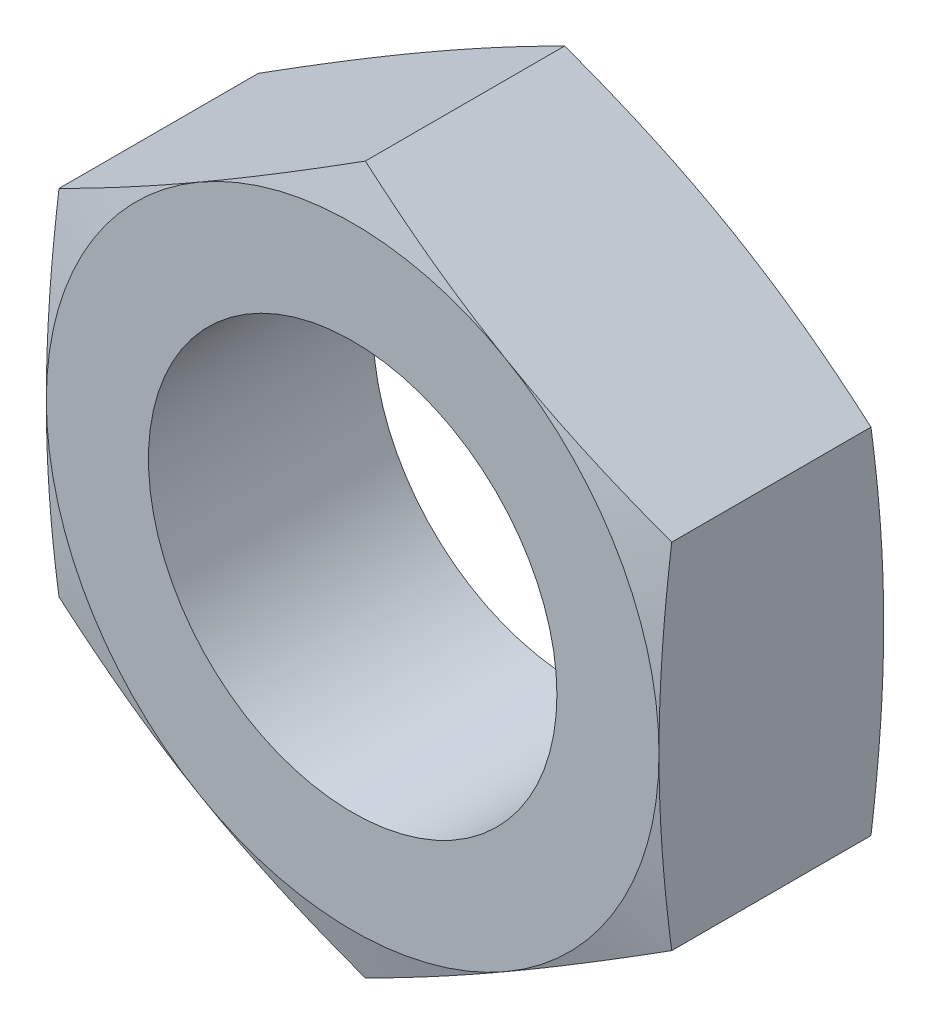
ISO-10303-21;
HEADER;
FILE_DESCRIPTION(('STEP AP214'),'2;1');
FILE_NAME('part.step','',(''),(''),'','','');
FILE_SCHEMA(('AUTOMOTIVE_DESIGN { 1 0 10303 214 1 1 1 1 }'));
ENDSEC;
DATA;
#1=APPLICATION_CONTEXT('core data for automotive mechanical design processes');
#2=APPLICATION_PROTOCOL_DEFINITION('international standard','automotive_design',2000,#1);
#3=PRODUCT_CONTEXT('',#1,'mechanical');
#4=PRODUCT('Part','Part','',(#3));
#5=PRODUCT_RELATED_PRODUCT_CATEGORY('part','',(#4));
#6=PRODUCT_DEFINITION_FORMATION('','',#4);
#7=PRODUCT_DEFINITION_CONTEXT('part definition',#1,'design');
#8=PRODUCT_DEFINITION('design','',#6,#7);
#9=PRODUCT_DEFINITION_SHAPE('','',#8);
#10=(LENGTH_UNIT() NAMED_UNIT(*) SI_UNIT(.MILLI.,.METRE.));
#11=(NAMED_UNIT(*) PLANE_ANGLE_UNIT() SI_UNIT($,.RADIAN.));
#12=(NAMED_UNIT(*) SI_UNIT($,.STERADIAN.) SOLID_ANGLE_UNIT());
#13=UNCERTAINTY_MEASURE_WITH_UNIT(LENGTH_MEASURE(1.E-05),#10,'distance_accuracy_value','');
#14=(GEOMETRIC_REPRESENTATION_CONTEXT(3) GLOBAL_UNCERTAINTY_ASSIGNED_CONTEXT((#13)) GLOBAL_UNIT_ASSIGNED_CONTEXT((#10,
#11,#12)) REPRESENTATION_CONTEXT('',''));
#15=CARTESIAN_POINT('',(0.,0.,0.));
#16=DIRECTION('',(0.,0.,1.));
#17=DIRECTION('',(1.,0.,0.));
#18=AXIS2_PLACEMENT_3D('',#15,#16,#17);
#19=CARTESIAN_POINT('',(0.,0.,11.));
#20=DIRECTION('',(0.,0.,1.));
#21=DIRECTION('',(1.,0.,0.));
#22=AXIS2_PLACEMENT_3D('',#19,#20,#21);
#23=PLANE('',#22);
#24=CARTESIAN_POINT('',(0.,0.,11.));
#25=DIRECTION('',(0.,0.,1.));
#26=DIRECTION('',(1.,0.,0.));
#27=AXIS2_PLACEMENT_3D('',#24,#25,#26);
#28=CIRCLE('',#27,10.);
#29=CARTESIAN_POINT('',(10.,0.,11.));
#30=VERTEX_POINT('',#29);
#31=EDGE_CURVE('E238',#30,#30,#28,.T.);
#32=ORIENTED_EDGE('',*,*,#31,.F.);
#33=EDGE_LOOP('',(#32));
#34=FACE_BOUND('',#33,.T.);
#35=CARTESIAN_POINT('',(0.,0.,11.));
#36=DIRECTION('',(0.,0.,1.));
#37=DIRECTION('',(1.,0.,0.));
#38=AXIS2_PLACEMENT_3D('',#35,#36,#37);
#39=CIRCLE('',#38,15.);
#40=CARTESIAN_POINT('',(7.5,-12.9903810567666,11.));
#41=VERTEX_POINT('',#40);
#42=CARTESIAN_POINT('',(15.,0.,11.));
#43=VERTEX_POINT('',#42);
#44=EDGE_CURVE('E150',#41,#43,#39,.T.);
#45=ORIENTED_EDGE('',*,*,#44,.T.);
#46=CARTESIAN_POINT('',(7.5,12.9903810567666,11.));
#47=VERTEX_POINT('',#46);
#48=EDGE_CURVE('E152',#43,#47,#39,.T.);
#49=ORIENTED_EDGE('',*,*,#48,.T.);
#50=CARTESIAN_POINT('',(-7.5,12.9903810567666,11.));
#51=VERTEX_POINT('',#50);
#52=EDGE_CURVE('E372',#47,#51,#39,.T.);
#53=ORIENTED_EDGE('',*,*,#52,.T.);
#54=CARTESIAN_POINT('',(-15.,0.,11.));
#55=VERTEX_POINT('',#54);
#56=EDGE_CURVE('E36',#51,#55,#39,.T.);
#57=ORIENTED_EDGE('',*,*,#56,.T.);
#58=CARTESIAN_POINT('',(-7.5,-12.9903810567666,11.));
#59=VERTEX_POINT('',#58);
#60=EDGE_CURVE('E44',#55,#59,#39,.T.);
#61=ORIENTED_EDGE('',*,*,#60,.T.);
#62=EDGE_CURVE('E374',#59,#41,#39,.T.);
#63=ORIENTED_EDGE('',*,*,#62,.T.);
#64=EDGE_LOOP('',(#45,#49,#53,#57,#61,#63));
#65=FACE_BOUND('',#64,.T.);
#66=ADVANCED_FACE('F14',(#34,#65),#23,.T.);
#67=CARTESIAN_POINT('',(0.,0.,0.));
#68=DIRECTION('',(0.,0.,1.));
#69=DIRECTION('',(1.,0.,0.));
#70=AXIS2_PLACEMENT_3D('',#67,#68,#69);
#71=PLANE('',#70);
#72=CARTESIAN_POINT('',(0.,0.,0.));
#73=DIRECTION('',(0.,0.,1.));
#74=DIRECTION('',(1.,0.,0.));
#75=AXIS2_PLACEMENT_3D('',#72,#73,#74);
#76=CIRCLE('',#75,10.);
#77=CARTESIAN_POINT('',(10.,0.,0.));
#78=VERTEX_POINT('',#77);
#79=EDGE_CURVE('E242',#78,#78,#76,.T.);
#80=ORIENTED_EDGE('',*,*,#79,.T.);
#81=EDGE_LOOP('',(#80));
#82=FACE_BOUND('',#81,.T.);
#83=CARTESIAN_POINT('',(0.,0.,0.));
#84=DIRECTION('',(0.,0.,1.));
#85=DIRECTION('',(1.,0.,0.));
#86=AXIS2_PLACEMENT_3D('',#83,#84,#85);
#87=CIRCLE('',#86,15.);
#88=CARTESIAN_POINT('',(15.,0.,0.));
#89=VERTEX_POINT('',#88);
#90=CARTESIAN_POINT('',(7.5,12.9903810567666,0.));
#91=VERTEX_POINT('',#90);
#92=EDGE_CURVE('E122',#89,#91,#87,.T.);
#93=ORIENTED_EDGE('',*,*,#92,.F.);
#94=CARTESIAN_POINT('',(7.5,-12.9903810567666,0.));
#95=VERTEX_POINT('',#94);
#96=EDGE_CURVE('E151',#95,#89,#87,.T.);
#97=ORIENTED_EDGE('',*,*,#96,.F.);
#98=CARTESIAN_POINT('',(-7.5,-12.9903810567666,0.));
#99=VERTEX_POINT('',#98);
#100=EDGE_CURVE('E147',#99,#95,#87,.T.);
#101=ORIENTED_EDGE('',*,*,#100,.F.);
#102=CARTESIAN_POINT('',(-15.,0.,0.));
#103=VERTEX_POINT('',#102);
#104=EDGE_CURVE('E146',#103,#99,#87,.T.);
#105=ORIENTED_EDGE('',*,*,#104,.F.);
#106=CARTESIAN_POINT('',(-7.5,12.9903810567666,0.));
#107=VERTEX_POINT('',#106);
#108=EDGE_CURVE('E123',#107,#103,#87,.T.);
#109=ORIENTED_EDGE('',*,*,#108,.F.);
#110=EDGE_CURVE('E111',#91,#107,#87,.T.);
#111=ORIENTED_EDGE('',*,*,#110,.F.);
#112=EDGE_LOOP('',(#93,#97,#101,#105,#109,#111));
#113=FACE_BOUND('',#112,.T.);
#114=ADVANCED_FACE('F144',(#82,#113),#71,.F.);
#115=CARTESIAN_POINT('',(0.,0.,11.));
#116=DIRECTION('',(0.,0.,-1.));
#117=DIRECTION('',(-1.,0.,0.));
#118=AXIS2_PLACEMENT_3D('',#115,#116,#117);
#119=CYLINDRICAL_SURFACE('',#118,10.);
#120=ORIENTED_EDGE('',*,*,#31,.T.);
#121=EDGE_LOOP('',(#120));
#122=FACE_BOUND('',#121,.T.);
#123=ORIENTED_EDGE('',*,*,#79,.F.);
#124=EDGE_LOOP('',(#123));
#125=FACE_BOUND('',#124,.T.);
#126=ADVANCED_FACE('F182',(#122,#125),#119,.F.);
#127=CARTESIAN_POINT('',(0.,0.,1.64069528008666));
#128=DIRECTION('',(0.,0.,1.));
#129=DIRECTION('',(1.,0.,0.));
#130=AXIS2_PLACEMENT_3D('',#127,#128,#129);
#131=CONICAL_SURFACE('',#130,21.123158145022,1.30899693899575);
#132=CARTESIAN_POINT('',(15.0002,-8.66013856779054,0.621809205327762));
#133=CARTESIAN_POINT('',(14.3772710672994,-9.01978675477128,0.525403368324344));
#134=CARTESIAN_POINT('',(13.7532127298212,-9.38008700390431,0.437882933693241));
#135=CARTESIAN_POINT('',(12.5028922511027,-10.1019598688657,0.284117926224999));
#136=CARTESIAN_POINT('',(11.8766293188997,-10.4635329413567,0.21788199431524));
#137=CARTESIAN_POINT('',(10.6256964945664,-11.1857593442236,0.110552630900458));
#138=CARTESIAN_POINT('',(10.0010350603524,-11.5464077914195,0.069331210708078));
#139=CARTESIAN_POINT('',(8.7509156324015,-12.2681645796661,0.0140575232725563));
#140=CARTESIAN_POINT('',(8.12545781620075,-12.6292728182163,0.));
#141=CARTESIAN_POINT('',(6.87454218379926,-13.3514892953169,0.));
#142=CARTESIAN_POINT('',(6.24908436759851,-13.7125975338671,0.0140575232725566));
#143=CARTESIAN_POINT('',(4.99896493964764,-14.4343543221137,0.0693312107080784));
#144=CARTESIAN_POINT('',(4.37430350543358,-14.7950027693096,0.110552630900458));
#145=CARTESIAN_POINT('',(3.12337068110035,-15.5172291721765,0.217881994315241));
#146=CARTESIAN_POINT('',(2.49710774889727,-15.8788022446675,0.284117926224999));
#147=CARTESIAN_POINT('',(1.24678727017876,-16.6006751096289,0.437882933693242));
#148=CARTESIAN_POINT('',(0.622728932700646,-16.9609753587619,0.525403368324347));
#149=CARTESIAN_POINT('',(-0.000200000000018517,-17.3206235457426,0.621809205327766));
#150=B_SPLINE_CURVE_WITH_KNOTS('',3,(#132,#133,#134,#135,#136,#137,#138,#139,#140,#141,#142,
#143,#144,#145,#146,#147,#148,#149),.UNSPECIFIED.,.F.,.F.,(4,2,2,2,2,2,2,2,4),(0.,
2.17729853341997,4.35547987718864,6.52242029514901,8.68894138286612,10.8554624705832,
13.0224028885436,15.2005842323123,17.3778827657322),.UNSPECIFIED.);
#151=CARTESIAN_POINT('',(15.,-8.66025403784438,0.621778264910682));
#152=VERTEX_POINT('',#151);
#153=EDGE_CURVE('E153',#152,#95,#150,.T.);
#154=ORIENTED_EDGE('',*,*,#153,.T.);
#155=ORIENTED_EDGE('',*,*,#96,.T.);
#156=CARTESIAN_POINT('',(15.,-22.9699203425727,3.33164551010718));
#157=CARTESIAN_POINT('',(15.,-22.288720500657,3.17885963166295));
#158=CARTESIAN_POINT('',(15.,-21.6070962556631,3.02793226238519));
#159=CARTESIAN_POINT('',(15.,-20.2427903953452,2.73079782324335));
#160=CARTESIAN_POINT('',(15.,-19.5601087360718,2.58459095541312));
#161=CARTESIAN_POINT('',(15.,-18.192876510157,2.2977753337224));
#162=CARTESIAN_POINT('',(15.,-17.5083247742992,2.15717213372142));
#163=CARTESIAN_POINT('',(15.,-16.1378008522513,1.88307184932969));
#164=CARTESIAN_POINT('',(15.,-15.4518286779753,1.74957470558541));
#165=CARTESIAN_POINT('',(15.,-14.0836898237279,1.49240952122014));
#166=CARTESIAN_POINT('',(15.,-13.4015363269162,1.36867168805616));
#167=CARTESIAN_POINT('',(15.,-12.0353545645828,1.13192961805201));
#168=CARTESIAN_POINT('',(15.,-11.35132629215,1.01892542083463));
#169=CARTESIAN_POINT('',(15.,-9.98128099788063,0.806187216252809));
#170=CARTESIAN_POINT('',(15.,-9.29526424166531,0.706451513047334));
#171=CARTESIAN_POINT('',(15.,-7.92104574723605,0.523176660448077));
#172=CARTESIAN_POINT('',(15.,-7.23284400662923,0.439637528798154));
#173=CARTESIAN_POINT('',(15.,-5.84646558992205,0.291108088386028));
#174=CARTESIAN_POINT('',(15.,-5.14826471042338,0.226340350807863));
#175=CARTESIAN_POINT('',(15.,-3.75009465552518,0.119813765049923));
#176=CARTESIAN_POINT('',(15.,-3.05012552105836,0.0780543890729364));
#177=CARTESIAN_POINT('',(15.,-1.64943623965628,0.0199793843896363));
#178=CARTESIAN_POINT('',(15.,-0.948716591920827,0.00365195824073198));
#179=CARTESIAN_POINT('',(15.,0.45284136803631,-0.00255392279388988));
#180=CARTESIAN_POINT('',(15.,1.15367968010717,0.00756758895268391));
#181=CARTESIAN_POINT('',(15.,2.55704799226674,0.0536910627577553));
#182=CARTESIAN_POINT('',(15.,3.25957482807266,0.0897873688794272));
#183=CARTESIAN_POINT('',(15.,4.66298433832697,0.185794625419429));
#184=CARTESIAN_POINT('',(15.,5.36386697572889,0.245706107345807));
#185=CARTESIAN_POINT('',(15.,6.76398096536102,0.386302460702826));
#186=CARTESIAN_POINT('',(15.,7.4632109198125,0.467001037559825));
#187=CARTESIAN_POINT('',(15.,8.85941811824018,0.645795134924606));
#188=CARTESIAN_POINT('',(15.,9.55639535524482,0.743890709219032));
#189=CARTESIAN_POINT('',(15.,10.9074957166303,0.948173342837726));
#190=CARTESIAN_POINT('',(15.,11.5617422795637,1.05355220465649));
#191=CARTESIAN_POINT('',(15.,12.868494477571,1.27465052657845));
#192=CARTESIAN_POINT('',(15.,13.5210000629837,1.39037027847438));
#193=CARTESIAN_POINT('',(15.,14.8245209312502,1.63024703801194));
#194=CARTESIAN_POINT('',(15.,15.4755360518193,1.75440492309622));
#195=CARTESIAN_POINT('',(15.,16.7762074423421,2.00958916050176));
#196=CARTESIAN_POINT('',(15.,17.4258637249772,2.1406154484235));
#197=CARTESIAN_POINT('',(15.,18.7241773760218,2.40832075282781));
#198=CARTESIAN_POINT('',(15.,19.3728344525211,2.5450011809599));
#199=CARTESIAN_POINT('',(15.,20.669156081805,2.82298543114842));
#200=CARTESIAN_POINT('',(15.,21.3168206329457,2.96428926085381));
#201=CARTESIAN_POINT('',(15.,22.6112593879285,3.25071214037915));
#202=CARTESIAN_POINT('',(15.,23.2580336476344,3.39583093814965));
#203=CARTESIAN_POINT('',(15.,24.5508585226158,3.68925978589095));
#204=CARTESIAN_POINT('',(15.,25.1969091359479,3.83756984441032));
#205=CARTESIAN_POINT('',(15.,27.1213525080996,4.28352964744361));
#206=CARTESIAN_POINT('',(15.,28.3988444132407,4.58506650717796));
#207=CARTESIAN_POINT('',(15.,30.9520523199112,5.19564098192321));
#208=CARTESIAN_POINT('',(15.,32.2277682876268,5.50467873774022));
#209=CARTESIAN_POINT('',(15.,34.7762293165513,6.12792205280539));
#210=CARTESIAN_POINT('',(15.,36.0489760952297,6.44212059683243));
#211=CARTESIAN_POINT('',(15.,37.9572890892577,6.9165690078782));
#212=CARTESIAN_POINT('',(15.,38.5932484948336,7.07524095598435));
#213=CARTESIAN_POINT('',(15.,39.8649337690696,7.39351520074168));
#214=CARTESIAN_POINT('',(15.,40.5006596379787,7.55311749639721));
#215=CARTESIAN_POINT('',(15.,41.1362837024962,7.71312438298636));
#216=B_SPLINE_CURVE_WITH_KNOTS('',3,(#156,#157,#158,#159,#160,#161,#162,#163,#164,#165,#166,
#167,#168,#169,#170,#171,#172,#173,#174,#175,#176,#177,#178,#179,#180,#181,#182,#183,#184,#185,
#186,#187,#188,#189,#190,#191,#192,#193,#194,#195,#196,#197,#198,#199,#200,#201,#202,#203,#204,
#205,#206,#207,#208,#209,#210,#211,#212,#213,#214,#215),.UNSPECIFIED.,.F.,.F.,(4,2,2,2,2,2,2,2,
2,2,2,2,2,2,2,2,2,2,2,2,2,2,2,2,2,2,2,2,2,4),(0.,2.09437965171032,4.18884882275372,
6.28534468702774,8.3818230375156,10.4616102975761,12.5414052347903,14.6209340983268,
16.7004652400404,18.8037292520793,20.9069450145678,23.0091848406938,25.1114220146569,
27.2213335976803,29.331292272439,31.4426456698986,33.5540055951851,35.5419439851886,
37.5299384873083,39.5181400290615,41.5063229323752,43.4950052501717,45.4836908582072,
47.4722454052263,49.4608052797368,53.398558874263,57.3363864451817,61.2692436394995,
63.235607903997,65.2019700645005),.UNSPECIFIED.);
#217=EDGE_CURVE('E186',#89,#152,#216,.F.);
#218=ORIENTED_EDGE('',*,*,#217,.T.);
#219=EDGE_LOOP('',(#154,#155,#218));
#220=FACE_BOUND('',#219,.T.);
#221=ADVANCED_FACE('F179',(#220),#131,.T.);
#222=CARTESIAN_POINT('',(-0.00019999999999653,17.3206235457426,0.621809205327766));
#223=CARTESIAN_POINT('',(0.622728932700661,16.9609753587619,0.525403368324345));
#224=CARTESIAN_POINT('',(1.24678727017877,16.6006751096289,0.43788293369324));
#225=CARTESIAN_POINT('',(2.49710774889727,15.8788022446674,0.284117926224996));
#226=CARTESIAN_POINT('',(3.12337068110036,15.5172291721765,0.217881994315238));
#227=CARTESIAN_POINT('',(4.37430350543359,14.7950027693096,0.110552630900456));
#228=CARTESIAN_POINT('',(4.99896493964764,14.4343543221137,0.0693312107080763));
#229=CARTESIAN_POINT('',(6.24908436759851,13.7125975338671,0.014057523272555));
#230=CARTESIAN_POINT('',(6.87454218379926,13.3514892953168,0.));
#231=CARTESIAN_POINT('',(8.12545781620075,12.6292728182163,0.));
#232=CARTESIAN_POINT('',(8.7509156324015,12.2681645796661,0.0140575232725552));
#233=CARTESIAN_POINT('',(10.0010350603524,11.5464077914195,0.0693312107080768));
#234=CARTESIAN_POINT('',(10.6256964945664,11.1857593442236,0.110552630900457));
#235=CARTESIAN_POINT('',(11.8766293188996,10.4635329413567,0.217881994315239));
#236=CARTESIAN_POINT('',(12.5028922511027,10.1019598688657,0.284117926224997));
#237=CARTESIAN_POINT('',(13.7532127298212,9.38008700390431,0.43788293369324));
#238=CARTESIAN_POINT('',(14.3772710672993,9.01978675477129,0.525403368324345));
#239=CARTESIAN_POINT('',(15.0002,8.66013856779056,0.621809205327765));
#240=B_SPLINE_CURVE_WITH_KNOTS('',3,(#222,#223,#224,#225,#226,#227,#228,#229,#230,#231,#232,
#233,#234,#235,#236,#237,#238,#239),.UNSPECIFIED.,.F.,.F.,(4,2,2,2,2,2,2,2,4),(0.,
2.17729853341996,4.35547987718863,6.52242029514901,8.68894138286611,10.8554624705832,
13.0224028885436,15.2005842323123,17.3778827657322),.UNSPECIFIED.);
#241=CARTESIAN_POINT('',(15.,8.6602540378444,0.621778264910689));
#242=VERTEX_POINT('',#241);
#243=EDGE_CURVE('E162',#91,#242,#240,.T.);
#244=ORIENTED_EDGE('',*,*,#243,.T.);
#245=EDGE_CURVE('E257',#242,#89,#216,.F.);
#246=ORIENTED_EDGE('',*,*,#245,.T.);
#247=ORIENTED_EDGE('',*,*,#92,.T.);
#248=EDGE_LOOP('',(#244,#246,#247));
#249=FACE_BOUND('',#248,.T.);
#250=ADVANCED_FACE('F277',(#249),#131,.T.);
#251=CARTESIAN_POINT('',(0.,0.,11.));
#252=DIRECTION('',(0.,0.,-1.));
#253=DIRECTION('',(-1.,0.,0.));
#254=AXIS2_PLACEMENT_3D('',#251,#252,#253);
#255=CONICAL_SURFACE('',#254,15.,1.30899693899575);
#256=CARTESIAN_POINT('',(15.0002,8.66013856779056,10.3781907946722));
#257=CARTESIAN_POINT('',(14.3772710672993,9.01978675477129,10.4745966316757));
#258=CARTESIAN_POINT('',(13.7532127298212,9.38008700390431,10.5621170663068));
#259=CARTESIAN_POINT('',(12.5028922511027,10.1019598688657,10.715882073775));
#260=CARTESIAN_POINT('',(11.8766293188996,10.4635329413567,10.7821180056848));
#261=CARTESIAN_POINT('',(10.6256964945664,11.1857593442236,10.8894473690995));
#262=CARTESIAN_POINT('',(10.0010350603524,11.5464077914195,10.9306687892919));
#263=CARTESIAN_POINT('',(8.7509156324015,12.2681645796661,10.9859424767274));
#264=CARTESIAN_POINT('',(8.12545781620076,12.6292728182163,11.));
#265=CARTESIAN_POINT('',(6.87454218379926,13.3514892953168,11.));
#266=CARTESIAN_POINT('',(6.24908436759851,13.7125975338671,10.9859424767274));
#267=CARTESIAN_POINT('',(4.99896493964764,14.4343543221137,10.9306687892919));
#268=CARTESIAN_POINT('',(4.37430350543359,14.7950027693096,10.8894473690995));
#269=CARTESIAN_POINT('',(3.12337068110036,15.5172291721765,10.7821180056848));
#270=CARTESIAN_POINT('',(2.49710774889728,15.8788022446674,10.715882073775));
#271=CARTESIAN_POINT('',(1.24678727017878,16.6006751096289,10.5621170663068));
#272=CARTESIAN_POINT('',(0.622728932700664,16.9609753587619,10.4745966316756));
#273=CARTESIAN_POINT('',(-0.000199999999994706,17.3206235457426,10.3781907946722));
#274=B_SPLINE_CURVE_WITH_KNOTS('',3,(#256,#257,#258,#259,#260,#261,#262,#263,#264,#265,#266,
#267,#268,#269,#270,#271,#272,#273),.UNSPECIFIED.,.F.,.F.,(4,2,2,2,2,2,2,2,4),(0.,
2.17729853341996,4.35547987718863,6.522420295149,8.68894138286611,10.8554624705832,
13.0224028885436,15.2005842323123,17.3778827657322),.UNSPECIFIED.);
#275=CARTESIAN_POINT('',(15.,8.6602540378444,10.3782217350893));
#276=VERTEX_POINT('',#275);
#277=EDGE_CURVE('E237',#276,#47,#274,.T.);
#278=ORIENTED_EDGE('',*,*,#277,.T.);
#279=ORIENTED_EDGE('',*,*,#48,.F.);
#280=CARTESIAN_POINT('',(15.,-22.9699203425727,7.66835448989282));
#281=CARTESIAN_POINT('',(15.,-22.288720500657,7.82114036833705));
#282=CARTESIAN_POINT('',(15.,-21.6070962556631,7.97206773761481));
#283=CARTESIAN_POINT('',(15.,-20.2427903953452,8.26920217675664));
#284=CARTESIAN_POINT('',(15.,-19.5601087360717,8.41540904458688));
#285=CARTESIAN_POINT('',(15.,-18.192876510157,8.7022246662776));
#286=CARTESIAN_POINT('',(15.,-17.5083247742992,8.84282786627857));
#287=CARTESIAN_POINT('',(15.,-16.1378008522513,9.11692815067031));
#288=CARTESIAN_POINT('',(15.,-15.4518286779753,9.25042529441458));
#289=CARTESIAN_POINT('',(15.,-14.0836898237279,9.50759047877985));
#290=CARTESIAN_POINT('',(15.,-13.4015363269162,9.63132831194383));
#291=CARTESIAN_POINT('',(15.,-12.0353545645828,9.86807038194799));
#292=CARTESIAN_POINT('',(15.,-11.35132629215,9.98107457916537));
#293=CARTESIAN_POINT('',(15.,-9.98128099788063,10.1938127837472));
#294=CARTESIAN_POINT('',(15.,-9.29526424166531,10.2935484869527));
#295=CARTESIAN_POINT('',(15.,-7.92104574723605,10.4768233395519));
#296=CARTESIAN_POINT('',(15.,-7.23284400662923,10.5603624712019));
#297=CARTESIAN_POINT('',(15.,-5.84646558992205,10.708891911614));
#298=CARTESIAN_POINT('',(15.,-5.14826471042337,10.7736596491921));
#299=CARTESIAN_POINT('',(15.,-3.75009465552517,10.8801862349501));
#300=CARTESIAN_POINT('',(15.,-3.05012552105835,10.9219456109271));
#301=CARTESIAN_POINT('',(15.,-1.64943623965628,10.9800206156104));
#302=CARTESIAN_POINT('',(15.,-0.948716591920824,10.9963480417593));
#303=CARTESIAN_POINT('',(15.,0.452841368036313,11.0025539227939));
#304=CARTESIAN_POINT('',(15.,1.15367968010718,10.9924324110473));
#305=CARTESIAN_POINT('',(15.,2.55704799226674,10.9463089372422));
#306=CARTESIAN_POINT('',(15.,3.25957482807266,10.9102126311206));
#307=CARTESIAN_POINT('',(15.,4.66298433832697,10.8142053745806));
#308=CARTESIAN_POINT('',(15.,5.36386697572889,10.7542938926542));
#309=CARTESIAN_POINT('',(15.,6.76398096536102,10.6136975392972));
#310=CARTESIAN_POINT('',(15.,7.4632109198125,10.5329989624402));
#311=CARTESIAN_POINT('',(15.,8.85941811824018,10.3542048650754));
#312=CARTESIAN_POINT('',(15.,9.55639535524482,10.256109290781));
#313=CARTESIAN_POINT('',(15.,10.9074957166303,10.0518266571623));
#314=CARTESIAN_POINT('',(15.,11.5617422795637,9.94644779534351));
#315=CARTESIAN_POINT('',(15.,12.868494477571,9.72534947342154));
#316=CARTESIAN_POINT('',(15.,13.5210000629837,9.60962972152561));
#317=CARTESIAN_POINT('',(15.,14.8245209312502,9.36975296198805));
#318=CARTESIAN_POINT('',(15.,15.4755360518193,9.24559507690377));
#319=CARTESIAN_POINT('',(15.,16.7762074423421,8.99041083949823));
#320=CARTESIAN_POINT('',(15.,17.4258637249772,8.85938455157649));
#321=CARTESIAN_POINT('',(15.,18.7241773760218,8.59167924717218));
#322=CARTESIAN_POINT('',(15.,19.3728344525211,8.45499881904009));
#323=CARTESIAN_POINT('',(15.,20.669156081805,8.17701456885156));
#324=CARTESIAN_POINT('',(15.,21.3168206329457,8.03571073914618));
#325=CARTESIAN_POINT('',(15.,22.6112593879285,7.74928785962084));
#326=CARTESIAN_POINT('',(15.,23.2580336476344,7.60416906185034));
#327=CARTESIAN_POINT('',(15.,24.5508585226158,7.31074021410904));
#328=CARTESIAN_POINT('',(15.,25.1969091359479,7.16243015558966));
#329=CARTESIAN_POINT('',(15.,27.1213525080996,6.71647035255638));
#330=CARTESIAN_POINT('',(15.,28.3988444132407,6.41493349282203));
#331=CARTESIAN_POINT('',(15.,30.9520523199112,5.80435901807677));
#332=CARTESIAN_POINT('',(15.,32.2277682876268,5.49532126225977));
#333=CARTESIAN_POINT('',(15.,34.7762293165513,4.87207794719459));
#334=CARTESIAN_POINT('',(15.,36.0489760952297,4.55787940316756));
#335=CARTESIAN_POINT('',(15.,37.9572890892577,4.08343099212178));
#336=CARTESIAN_POINT('',(15.,38.5932484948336,3.92475904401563));
#337=CARTESIAN_POINT('',(15.,39.8649337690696,3.6064847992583));
#338=CARTESIAN_POINT('',(15.,40.5006596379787,3.44688250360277));
#339=CARTESIAN_POINT('',(15.,41.1362837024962,3.28687561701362));
#340=B_SPLINE_CURVE_WITH_KNOTS('',3,(#280,#281,#282,#283,#284,#285,#286,#287,#288,#289,#290,
#291,#292,#293,#294,#295,#296,#297,#298,#299,#300,#301,#302,#303,#304,#305,#306,#307,#308,#309,
#310,#311,#312,#313,#314,#315,#316,#317,#318,#319,#320,#321,#322,#323,#324,#325,#326,#327,#328,
#329,#330,#331,#332,#333,#334,#335,#336,#337,#338,#339),.UNSPECIFIED.,.F.,.F.,(4,2,2,2,2,2,2,2,
2,2,2,2,2,2,2,2,2,2,2,2,2,2,2,2,2,2,2,2,2,4),(0.,2.09437965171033,4.18884882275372,
6.28534468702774,8.3818230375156,10.4616102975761,12.5414052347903,14.6209340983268,
16.7004652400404,18.8037292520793,20.9069450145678,23.0091848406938,25.1114220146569,
27.2213335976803,29.331292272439,31.4426456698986,33.5540055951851,35.5419439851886,
37.5299384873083,39.5181400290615,41.5063229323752,43.4950052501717,45.4836908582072,
47.4722454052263,49.4608052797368,53.398558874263,57.3363864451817,61.2692436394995,
63.235607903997,65.2019700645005),.UNSPECIFIED.);
#341=EDGE_CURVE('E19',#43,#276,#340,.T.);
#342=ORIENTED_EDGE('',*,*,#341,.T.);
#343=EDGE_LOOP('',(#278,#279,#342));
#344=FACE_BOUND('',#343,.T.);
#345=ADVANCED_FACE('F180',(#344),#255,.T.);
#346=CARTESIAN_POINT('',(-0.000200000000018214,-17.3206235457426,10.3781907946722));
#347=CARTESIAN_POINT('',(0.622728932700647,-16.9609753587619,10.4745966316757));
#348=CARTESIAN_POINT('',(1.24678727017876,-16.6006751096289,10.5621170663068));
#349=CARTESIAN_POINT('',(2.49710774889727,-15.8788022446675,10.715882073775));
#350=CARTESIAN_POINT('',(3.12337068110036,-15.5172291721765,10.7821180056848));
#351=CARTESIAN_POINT('',(4.37430350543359,-14.7950027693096,10.8894473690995));
#352=CARTESIAN_POINT('',(4.99896493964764,-14.4343543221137,10.9306687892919));
#353=CARTESIAN_POINT('',(6.24908436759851,-13.7125975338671,10.9859424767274));
#354=CARTESIAN_POINT('',(6.87454218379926,-13.3514892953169,11.));
#355=CARTESIAN_POINT('',(8.12545781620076,-12.6292728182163,11.));
#356=CARTESIAN_POINT('',(8.7509156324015,-12.2681645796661,10.9859424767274));
#357=CARTESIAN_POINT('',(10.0010350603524,-11.5464077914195,10.9306687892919));
#358=CARTESIAN_POINT('',(10.6256964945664,-11.1857593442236,10.8894473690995));
#359=CARTESIAN_POINT('',(11.8766293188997,-10.4635329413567,10.7821180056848));
#360=CARTESIAN_POINT('',(12.5028922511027,-10.1019598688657,10.715882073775));
#361=CARTESIAN_POINT('',(13.7532127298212,-9.38008700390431,10.5621170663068));
#362=CARTESIAN_POINT('',(14.3772710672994,-9.01978675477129,10.4745966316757));
#363=CARTESIAN_POINT('',(15.0002,-8.66013856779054,10.3781907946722));
#364=B_SPLINE_CURVE_WITH_KNOTS('',3,(#346,#347,#348,#349,#350,#351,#352,#353,#354,#355,#356,
#357,#358,#359,#360,#361,#362,#363),.UNSPECIFIED.,.F.,.F.,(4,2,2,2,2,2,2,2,4),(0.,
2.17729853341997,4.35547987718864,6.52242029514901,8.68894138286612,10.8554624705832,
13.0224028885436,15.2005842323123,17.3778827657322),.UNSPECIFIED.);
#365=CARTESIAN_POINT('',(15.,-8.66025403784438,10.3782217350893));
#366=VERTEX_POINT('',#365);
#367=EDGE_CURVE('E285',#41,#366,#364,.T.);
#368=ORIENTED_EDGE('',*,*,#367,.T.);
#369=EDGE_CURVE('E9',#366,#43,#340,.T.);
#370=ORIENTED_EDGE('',*,*,#369,.T.);
#371=ORIENTED_EDGE('',*,*,#44,.F.);
#372=EDGE_LOOP('',(#368,#370,#371));
#373=FACE_BOUND('',#372,.T.);
#374=ADVANCED_FACE('F341',(#373),#255,.T.);
#375=CARTESIAN_POINT('',(0.000199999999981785,-17.3206235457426,0.621809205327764));
#376=CARTESIAN_POINT('',(-0.622728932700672,-16.9609753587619,0.525403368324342));
#377=CARTESIAN_POINT('',(-1.24678727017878,-16.6006751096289,0.437882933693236));
#378=CARTESIAN_POINT('',(-2.49710774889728,-15.8788022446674,0.284117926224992));
#379=CARTESIAN_POINT('',(-3.12337068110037,-15.5172291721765,0.217881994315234));
#380=CARTESIAN_POINT('',(-4.3743035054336,-14.7950027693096,0.110552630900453));
#381=CARTESIAN_POINT('',(-4.99896493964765,-14.4343543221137,0.0693312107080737));
#382=CARTESIAN_POINT('',(-6.24908436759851,-13.7125975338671,0.0140575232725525));
#383=CARTESIAN_POINT('',(-6.87454218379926,-13.3514892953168,0.));
#384=CARTESIAN_POINT('',(-8.12545781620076,-12.6292728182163,0.));
#385=CARTESIAN_POINT('',(-8.7509156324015,-12.2681645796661,0.0140575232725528));
#386=CARTESIAN_POINT('',(-10.0010350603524,-11.5464077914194,0.069331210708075));
#387=CARTESIAN_POINT('',(-10.6256964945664,-11.1857593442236,0.110552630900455));
#388=CARTESIAN_POINT('',(-11.8766293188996,-10.4635329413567,0.217881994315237));
#389=CARTESIAN_POINT('',(-12.5028922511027,-10.1019598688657,0.284117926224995));
#390=CARTESIAN_POINT('',(-13.7532127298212,-9.3800870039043,0.437882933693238));
#391=CARTESIAN_POINT('',(-14.3772710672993,-9.01978675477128,0.525403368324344));
#392=CARTESIAN_POINT('',(-15.0002,-8.66013856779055,0.621809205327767));
#393=B_SPLINE_CURVE_WITH_KNOTS('',3,(#375,#376,#377,#378,#379,#380,#381,#382,#383,#384,#385,
#386,#387,#388,#389,#390,#391,#392),.UNSPECIFIED.,.F.,.F.,(4,2,2,2,2,2,2,2,4),(0.,
2.17729853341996,4.35547987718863,6.522420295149,8.6889413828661,10.8554624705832,
13.0224028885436,15.2005842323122,17.3778827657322),.UNSPECIFIED.);
#394=CARTESIAN_POINT('',(0.,-17.3205080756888,0.62177826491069));
#395=VERTEX_POINT('',#394);
#396=EDGE_CURVE('E142',#395,#99,#393,.T.);
#397=ORIENTED_EDGE('',*,*,#396,.T.);
#398=ORIENTED_EDGE('',*,*,#100,.T.);
#399=EDGE_CURVE('E163',#95,#395,#150,.T.);
#400=ORIENTED_EDGE('',*,*,#399,.T.);
#401=EDGE_LOOP('',(#397,#398,#400));
#402=FACE_BOUND('',#401,.T.);
#403=ADVANCED_FACE('F338',(#402),#131,.T.);
#404=CARTESIAN_POINT('',(-15.0002,-8.66013856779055,10.3781907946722));
#405=CARTESIAN_POINT('',(-14.3772710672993,-9.01978675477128,10.4745966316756));
#406=CARTESIAN_POINT('',(-13.7532127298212,-9.3800870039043,10.5621170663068));
#407=CARTESIAN_POINT('',(-12.5028922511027,-10.1019598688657,10.715882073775));
#408=CARTESIAN_POINT('',(-11.8766293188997,-10.4635329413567,10.7821180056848));
#409=CARTESIAN_POINT('',(-10.6256964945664,-11.1857593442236,10.8894473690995));
#410=CARTESIAN_POINT('',(-10.0010350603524,-11.5464077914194,10.9306687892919));
#411=CARTESIAN_POINT('',(-8.7509156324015,-12.2681645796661,10.9859424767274));
#412=CARTESIAN_POINT('',(-8.12545781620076,-12.6292728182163,11.));
#413=CARTESIAN_POINT('',(-6.87454218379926,-13.3514892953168,11.));
#414=CARTESIAN_POINT('',(-6.24908436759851,-13.7125975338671,10.9859424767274));
#415=CARTESIAN_POINT('',(-4.99896493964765,-14.4343543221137,10.9306687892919));
#416=CARTESIAN_POINT('',(-4.37430350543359,-14.7950027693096,10.8894473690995));
#417=CARTESIAN_POINT('',(-3.12337068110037,-15.5172291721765,10.7821180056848));
#418=CARTESIAN_POINT('',(-2.49710774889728,-15.8788022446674,10.715882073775));
#419=CARTESIAN_POINT('',(-1.24678727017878,-16.6006751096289,10.5621170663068));
#420=CARTESIAN_POINT('',(-0.622728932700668,-16.9609753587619,10.4745966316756));
#421=CARTESIAN_POINT('',(0.000199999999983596,-17.3206235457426,10.3781907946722));
#422=B_SPLINE_CURVE_WITH_KNOTS('',3,(#404,#405,#406,#407,#408,#409,#410,#411,#412,#413,#414,
#415,#416,#417,#418,#419,#420,#421),.UNSPECIFIED.,.F.,.F.,(4,2,2,2,2,2,2,2,4),(0.,
2.17729853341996,4.35547987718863,6.52242029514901,8.68894138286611,10.8554624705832,
13.0224028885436,15.2005842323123,17.3778827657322),.UNSPECIFIED.);
#423=CARTESIAN_POINT('',(0.,-17.3205080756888,10.3782217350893));
#424=VERTEX_POINT('',#423);
#425=EDGE_CURVE('E290',#59,#424,#422,.T.);
#426=ORIENTED_EDGE('',*,*,#425,.T.);
#427=EDGE_CURVE('E286',#424,#41,#364,.T.);
#428=ORIENTED_EDGE('',*,*,#427,.T.);
#429=ORIENTED_EDGE('',*,*,#62,.F.);
#430=EDGE_LOOP('',(#426,#428,#429));
#431=FACE_BOUND('',#430,.T.);
#432=ADVANCED_FACE('F177',(#431),#255,.T.);
#433=CARTESIAN_POINT('',(-15.,-22.9699203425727,3.33164551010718));
#434=CARTESIAN_POINT('',(-15.,-22.288720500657,3.17885963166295));
#435=CARTESIAN_POINT('',(-15.,-21.6070962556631,3.02793226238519));
#436=CARTESIAN_POINT('',(-15.,-20.2427903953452,2.73079782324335));
#437=CARTESIAN_POINT('',(-15.,-19.5601087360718,2.58459095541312));
#438=CARTESIAN_POINT('',(-15.,-18.192876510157,2.2977753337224));
#439=CARTESIAN_POINT('',(-15.,-17.5083247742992,2.15717213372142));
#440=CARTESIAN_POINT('',(-15.,-16.1378008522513,1.88307184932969));
#441=CARTESIAN_POINT('',(-15.,-15.4518286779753,1.74957470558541));
#442=CARTESIAN_POINT('',(-15.,-14.0836898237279,1.49240952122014));
#443=CARTESIAN_POINT('',(-15.,-13.4015363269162,1.36867168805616));
#444=CARTESIAN_POINT('',(-15.,-12.0353545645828,1.13192961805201));
#445=CARTESIAN_POINT('',(-15.,-11.35132629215,1.01892542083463));
#446=CARTESIAN_POINT('',(-15.,-9.98128099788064,0.80618721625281));
#447=CARTESIAN_POINT('',(-15.,-9.29526424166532,0.706451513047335));
#448=CARTESIAN_POINT('',(-15.,-7.92104574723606,0.52317666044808));
#449=CARTESIAN_POINT('',(-15.,-7.23284400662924,0.439637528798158));
#450=CARTESIAN_POINT('',(-15.,-5.84646558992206,0.291108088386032));
#451=CARTESIAN_POINT('',(-15.,-5.14826471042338,0.226340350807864));
#452=CARTESIAN_POINT('',(-15.,-3.75009465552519,0.119813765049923));
#453=CARTESIAN_POINT('',(-15.,-3.05012552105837,0.0780543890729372));
#454=CARTESIAN_POINT('',(-15.,-1.64943623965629,0.0199793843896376));
#455=CARTESIAN_POINT('',(-15.,-0.948716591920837,0.00365195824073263));
#456=CARTESIAN_POINT('',(-15.,0.4528413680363,-0.00255392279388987));
#457=CARTESIAN_POINT('',(-15.,1.15367968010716,0.00756758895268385));
#458=CARTESIAN_POINT('',(-15.,2.55704799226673,0.053691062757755));
#459=CARTESIAN_POINT('',(-15.,3.25957482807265,0.0897873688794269));
#460=CARTESIAN_POINT('',(-15.,4.66298433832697,0.185794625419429));
#461=CARTESIAN_POINT('',(-15.,5.36386697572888,0.245706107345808));
#462=CARTESIAN_POINT('',(-15.,6.76398096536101,0.386302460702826));
#463=CARTESIAN_POINT('',(-15.,7.4632109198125,0.467001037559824));
#464=CARTESIAN_POINT('',(-15.,8.85941811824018,0.645795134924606));
#465=CARTESIAN_POINT('',(-15.,9.55639535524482,0.743890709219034));
#466=CARTESIAN_POINT('',(-15.,10.9074957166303,0.948173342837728));
#467=CARTESIAN_POINT('',(-15.,11.5617422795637,1.05355220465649));
#468=CARTESIAN_POINT('',(-15.,12.868494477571,1.27465052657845));
#469=CARTESIAN_POINT('',(-15.,13.5210000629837,1.39037027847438));
#470=CARTESIAN_POINT('',(-15.,14.8245209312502,1.63024703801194));
#471=CARTESIAN_POINT('',(-15.,15.4755360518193,1.75440492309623));
#472=CARTESIAN_POINT('',(-15.,16.7762074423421,2.00958916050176));
#473=CARTESIAN_POINT('',(-15.,17.4258637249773,2.1406154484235));
#474=CARTESIAN_POINT('',(-15.,18.7241773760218,2.40832075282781));
#475=CARTESIAN_POINT('',(-15.,19.3728344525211,2.5450011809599));
#476=CARTESIAN_POINT('',(-15.,20.669156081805,2.82298543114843));
#477=CARTESIAN_POINT('',(-15.,21.3168206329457,2.96428926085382));
#478=CARTESIAN_POINT('',(-15.,22.6112593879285,3.25071214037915));
#479=CARTESIAN_POINT('',(-15.,23.2580336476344,3.39583093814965));
#480=CARTESIAN_POINT('',(-15.,24.5508585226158,3.68925978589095));
#481=CARTESIAN_POINT('',(-15.,25.1969091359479,3.83756984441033));
#482=CARTESIAN_POINT('',(-15.,27.1213525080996,4.28352964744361));
#483=CARTESIAN_POINT('',(-15.,28.3988444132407,4.58506650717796));
#484=CARTESIAN_POINT('',(-15.,30.9520523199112,5.19564098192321));
#485=CARTESIAN_POINT('',(-15.,32.2277682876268,5.50467873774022));
#486=CARTESIAN_POINT('',(-15.,34.7762293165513,6.12792205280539));
#487=CARTESIAN_POINT('',(-15.,36.0489760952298,6.44212059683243));
#488=CARTESIAN_POINT('',(-15.,37.9572890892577,6.9165690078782));
#489=CARTESIAN_POINT('',(-15.,38.5932484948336,7.07524095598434));
#490=CARTESIAN_POINT('',(-15.,39.8649337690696,7.39351520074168));
#491=CARTESIAN_POINT('',(-15.,40.5006596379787,7.55311749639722));
#492=CARTESIAN_POINT('',(-15.,41.1362837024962,7.71312438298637));
#493=B_SPLINE_CURVE_WITH_KNOTS('',3,(#433,#434,#435,#436,#437,#438,#439,#440,#441,#442,#443,
#444,#445,#446,#447,#448,#449,#450,#451,#452,#453,#454,#455,#456,#457,#458,#459,#460,#461,#462,
#463,#464,#465,#466,#467,#468,#469,#470,#471,#472,#473,#474,#475,#476,#477,#478,#479,#480,#481,
#482,#483,#484,#485,#486,#487,#488,#489,#490,#491,#492),.UNSPECIFIED.,.F.,.F.,(4,2,2,2,2,2,2,2,
2,2,2,2,2,2,2,2,2,2,2,2,2,2,2,2,2,2,2,2,2,4),(0.,2.09437965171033,4.18884882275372,
6.28534468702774,8.3818230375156,10.461610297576,12.5414052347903,14.6209340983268,
16.7004652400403,18.8037292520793,20.9069450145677,23.0091848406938,25.1114220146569,
27.2213335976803,29.331292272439,31.4426456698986,33.5540055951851,35.5419439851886,
37.5299384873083,39.5181400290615,41.5063229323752,43.4950052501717,45.4836908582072,
47.4722454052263,49.4608052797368,53.398558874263,57.3363864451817,61.2692436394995,
63.235607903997,65.2019700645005),.UNSPECIFIED.);
#494=CARTESIAN_POINT('',(-15.,-8.66025403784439,0.621778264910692));
#495=VERTEX_POINT('',#494);
#496=EDGE_CURVE('E284',#495,#103,#493,.T.);
#497=ORIENTED_EDGE('',*,*,#496,.T.);
#498=ORIENTED_EDGE('',*,*,#104,.T.);
#499=EDGE_CURVE('E135',#99,#495,#393,.T.);
#500=ORIENTED_EDGE('',*,*,#499,.T.);
#501=EDGE_LOOP('',(#497,#498,#500));
#502=FACE_BOUND('',#501,.T.);
#503=ADVANCED_FACE('F172',(#502),#131,.T.);
#504=CARTESIAN_POINT('',(-15.,-22.9699203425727,7.66835448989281));
#505=CARTESIAN_POINT('',(-15.,-22.288720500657,7.82114036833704));
#506=CARTESIAN_POINT('',(-15.,-21.6070962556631,7.9720677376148));
#507=CARTESIAN_POINT('',(-15.,-20.2427903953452,8.26920217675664));
#508=CARTESIAN_POINT('',(-15.,-19.5601087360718,8.41540904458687));
#509=CARTESIAN_POINT('',(-15.,-18.192876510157,8.7022246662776));
#510=CARTESIAN_POINT('',(-15.,-17.5083247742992,8.84282786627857));
#511=CARTESIAN_POINT('',(-15.,-16.1378008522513,9.1169281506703));
#512=CARTESIAN_POINT('',(-15.,-15.4518286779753,9.25042529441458));
#513=CARTESIAN_POINT('',(-15.,-14.0836898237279,9.50759047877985));
#514=CARTESIAN_POINT('',(-15.,-13.4015363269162,9.63132831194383));
#515=CARTESIAN_POINT('',(-15.,-12.0353545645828,9.86807038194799));
#516=CARTESIAN_POINT('',(-15.,-11.35132629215,9.98107457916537));
#517=CARTESIAN_POINT('',(-15.,-9.98128099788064,10.1938127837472));
#518=CARTESIAN_POINT('',(-15.,-9.29526424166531,10.2935484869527));
#519=CARTESIAN_POINT('',(-15.,-7.92104574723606,10.4768233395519));
#520=CARTESIAN_POINT('',(-15.,-7.23284400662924,10.5603624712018));
#521=CARTESIAN_POINT('',(-15.,-5.84646558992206,10.708891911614));
#522=CARTESIAN_POINT('',(-15.,-5.14826471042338,10.7736596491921));
#523=CARTESIAN_POINT('',(-15.,-3.75009465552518,10.8801862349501));
#524=CARTESIAN_POINT('',(-15.,-3.05012552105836,10.9219456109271));
#525=CARTESIAN_POINT('',(-15.,-1.64943623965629,10.9800206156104));
#526=CARTESIAN_POINT('',(-15.,-0.948716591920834,10.9963480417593));
#527=CARTESIAN_POINT('',(-15.,0.452841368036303,11.0025539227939));
#528=CARTESIAN_POINT('',(-15.,1.15367968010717,10.9924324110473));
#529=CARTESIAN_POINT('',(-15.,2.55704799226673,10.9463089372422));
#530=CARTESIAN_POINT('',(-15.,3.25957482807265,10.9102126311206));
#531=CARTESIAN_POINT('',(-15.,4.66298433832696,10.8142053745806));
#532=CARTESIAN_POINT('',(-15.,5.36386697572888,10.7542938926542));
#533=CARTESIAN_POINT('',(-15.,6.76398096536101,10.6136975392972));
#534=CARTESIAN_POINT('',(-15.,7.4632109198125,10.5329989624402));
#535=CARTESIAN_POINT('',(-15.,8.85941811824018,10.3542048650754));
#536=CARTESIAN_POINT('',(-15.,9.55639535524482,10.256109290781));
#537=CARTESIAN_POINT('',(-15.,10.9074957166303,10.0518266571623));
#538=CARTESIAN_POINT('',(-15.,11.5617422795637,9.94644779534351));
#539=CARTESIAN_POINT('',(-15.,12.868494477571,9.72534947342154));
#540=CARTESIAN_POINT('',(-15.,13.5210000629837,9.60962972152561));
#541=CARTESIAN_POINT('',(-15.,14.8245209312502,9.36975296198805));
#542=CARTESIAN_POINT('',(-15.,15.4755360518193,9.24559507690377));
#543=CARTESIAN_POINT('',(-15.,16.7762074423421,8.99041083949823));
#544=CARTESIAN_POINT('',(-15.,17.4258637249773,8.85938455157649));
#545=CARTESIAN_POINT('',(-15.,18.7241773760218,8.59167924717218));
#546=CARTESIAN_POINT('',(-15.,19.3728344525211,8.45499881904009));
#547=CARTESIAN_POINT('',(-15.,20.669156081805,8.17701456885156));
#548=CARTESIAN_POINT('',(-15.,21.3168206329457,8.03571073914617));
#549=CARTESIAN_POINT('',(-15.,22.6112593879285,7.74928785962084));
#550=CARTESIAN_POINT('',(-15.,23.2580336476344,7.60416906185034));
#551=CARTESIAN_POINT('',(-15.,24.5508585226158,7.31074021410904));
#552=CARTESIAN_POINT('',(-15.,25.1969091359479,7.16243015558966));
#553=CARTESIAN_POINT('',(-15.,27.1213525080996,6.71647035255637));
#554=CARTESIAN_POINT('',(-15.,28.3988444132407,6.41493349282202));
#555=CARTESIAN_POINT('',(-15.,30.9520523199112,5.80435901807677));
#556=CARTESIAN_POINT('',(-15.,32.2277682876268,5.49532126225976));
#557=CARTESIAN_POINT('',(-15.,34.7762293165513,4.87207794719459));
#558=CARTESIAN_POINT('',(-15.,36.0489760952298,4.55787940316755));
#559=CARTESIAN_POINT('',(-15.,37.9572890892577,4.08343099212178));
#560=CARTESIAN_POINT('',(-15.,38.5932484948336,3.92475904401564));
#561=CARTESIAN_POINT('',(-15.,39.8649337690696,3.6064847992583));
#562=CARTESIAN_POINT('',(-15.,40.5006596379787,3.44688250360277));
#563=CARTESIAN_POINT('',(-15.,41.1362837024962,3.28687561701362));
#564=B_SPLINE_CURVE_WITH_KNOTS('',3,(#504,#505,#506,#507,#508,#509,#510,#511,#512,#513,#514,
#515,#516,#517,#518,#519,#520,#521,#522,#523,#524,#525,#526,#527,#528,#529,#530,#531,#532,#533,
#534,#535,#536,#537,#538,#539,#540,#541,#542,#543,#544,#545,#546,#547,#548,#549,#550,#551,#552,
#553,#554,#555,#556,#557,#558,#559,#560,#561,#562,#563),.UNSPECIFIED.,.F.,.F.,(4,2,2,2,2,2,2,2,
2,2,2,2,2,2,2,2,2,2,2,2,2,2,2,2,2,2,2,2,2,4),(0.,2.09437965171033,4.18884882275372,
6.28534468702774,8.3818230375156,10.4616102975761,12.5414052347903,14.6209340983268,
16.7004652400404,18.8037292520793,20.9069450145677,23.0091848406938,25.1114220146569,
27.2213335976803,29.331292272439,31.4426456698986,33.5540055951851,35.5419439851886,
37.5299384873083,39.5181400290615,41.5063229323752,43.4950052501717,45.4836908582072,
47.4722454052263,49.4608052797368,53.398558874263,57.3363864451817,61.2692436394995,
63.235607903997,65.2019700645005),.UNSPECIFIED.);
#565=CARTESIAN_POINT('',(-15.,-8.66025403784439,10.3782217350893));
#566=VERTEX_POINT('',#565);
#567=EDGE_CURVE('E225',#55,#566,#564,.F.);
#568=ORIENTED_EDGE('',*,*,#567,.T.);
#569=EDGE_CURVE('E299',#566,#59,#422,.T.);
#570=ORIENTED_EDGE('',*,*,#569,.T.);
#571=ORIENTED_EDGE('',*,*,#60,.F.);
#572=EDGE_LOOP('',(#568,#570,#571));
#573=FACE_BOUND('',#572,.T.);
#574=ADVANCED_FACE('F176',(#573),#255,.T.);
#575=CARTESIAN_POINT('',(-15.,8.66025403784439,0.621778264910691));
#576=VERTEX_POINT('',#575);
#577=EDGE_CURVE('E131',#103,#576,#493,.T.);
#578=ORIENTED_EDGE('',*,*,#577,.T.);
#579=CARTESIAN_POINT('',(-15.0002,8.66013856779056,0.621809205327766));
#580=CARTESIAN_POINT('',(-14.3772710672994,9.0197867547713,0.525403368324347));
#581=CARTESIAN_POINT('',(-13.7532127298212,9.38008700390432,0.437882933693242));
#582=CARTESIAN_POINT('',(-12.5028922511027,10.1019598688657,0.284117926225));
#583=CARTESIAN_POINT('',(-11.8766293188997,10.4635329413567,0.217881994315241));
#584=CARTESIAN_POINT('',(-10.6256964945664,11.1857593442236,0.110552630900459));
#585=CARTESIAN_POINT('',(-10.0010350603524,11.5464077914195,0.0693312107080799));
#586=CARTESIAN_POINT('',(-8.75091563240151,12.2681645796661,0.0140575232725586));
#587=CARTESIAN_POINT('',(-8.12545781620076,12.6292728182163,0.));
#588=CARTESIAN_POINT('',(-6.87454218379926,13.3514892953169,0.));
#589=CARTESIAN_POINT('',(-6.24908436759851,13.7125975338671,0.0140575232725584));
#590=CARTESIAN_POINT('',(-4.99896493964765,14.4343543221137,0.0693312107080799));
#591=CARTESIAN_POINT('',(-4.3743035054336,14.7950027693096,0.11055263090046));
#592=CARTESIAN_POINT('',(-3.12337068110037,15.5172291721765,0.217881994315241));
#593=CARTESIAN_POINT('',(-2.49710774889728,15.8788022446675,0.284117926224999));
#594=CARTESIAN_POINT('',(-1.24678727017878,16.6006751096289,0.437882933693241));
#595=CARTESIAN_POINT('',(-0.622728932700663,16.9609753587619,0.525403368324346));
#596=CARTESIAN_POINT('',(0.000199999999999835,17.3206235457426,0.621809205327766));
#597=B_SPLINE_CURVE_WITH_KNOTS('',3,(#579,#580,#581,#582,#583,#584,#585,#586,#587,#588,#589,
#590,#591,#592,#593,#594,#595,#596),.UNSPECIFIED.,.F.,.F.,(4,2,2,2,2,2,2,2,4),(0.,
2.17729853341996,4.35547987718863,6.522420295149,8.68894138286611,10.8554624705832,
13.0224028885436,15.2005842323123,17.3778827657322),.UNSPECIFIED.);
#598=EDGE_CURVE('E127',#576,#107,#597,.T.);
#599=ORIENTED_EDGE('',*,*,#598,.T.);
#600=ORIENTED_EDGE('',*,*,#108,.T.);
#601=EDGE_LOOP('',(#578,#599,#600));
#602=FACE_BOUND('',#601,.T.);
#603=ADVANCED_FACE('F128',(#602),#131,.T.);
#604=CARTESIAN_POINT('',(0.000200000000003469,17.3206235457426,10.3781907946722));
#605=CARTESIAN_POINT('',(-0.622728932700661,16.9609753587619,10.4745966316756));
#606=CARTESIAN_POINT('',(-1.24678727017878,16.6006751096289,10.5621170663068));
#607=CARTESIAN_POINT('',(-2.49710774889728,15.8788022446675,10.715882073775));
#608=CARTESIAN_POINT('',(-3.12337068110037,15.5172291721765,10.7821180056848));
#609=CARTESIAN_POINT('',(-4.3743035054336,14.7950027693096,10.8894473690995));
#610=CARTESIAN_POINT('',(-4.99896493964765,14.4343543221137,10.9306687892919));
#611=CARTESIAN_POINT('',(-6.24908436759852,13.7125975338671,10.9859424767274));
#612=CARTESIAN_POINT('',(-6.87454218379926,13.3514892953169,11.));
#613=CARTESIAN_POINT('',(-8.12545781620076,12.6292728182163,11.));
#614=CARTESIAN_POINT('',(-8.75091563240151,12.2681645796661,10.9859424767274));
#615=CARTESIAN_POINT('',(-10.0010350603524,11.5464077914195,10.9306687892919));
#616=CARTESIAN_POINT('',(-10.6256964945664,11.1857593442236,10.8894473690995));
#617=CARTESIAN_POINT('',(-11.8766293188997,10.4635329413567,10.7821180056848));
#618=CARTESIAN_POINT('',(-12.5028922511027,10.1019598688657,10.715882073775));
#619=CARTESIAN_POINT('',(-13.7532127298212,9.38008700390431,10.5621170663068));
#620=CARTESIAN_POINT('',(-14.3772710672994,9.01978675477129,10.4745966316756));
#621=CARTESIAN_POINT('',(-15.0002,8.66013856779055,10.3781907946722));
#622=B_SPLINE_CURVE_WITH_KNOTS('',3,(#604,#605,#606,#607,#608,#609,#610,#611,#612,#613,#614,
#615,#616,#617,#618,#619,#620,#621),.UNSPECIFIED.,.F.,.F.,(4,2,2,2,2,2,2,2,4),(0.,
2.17729853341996,4.35547987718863,6.52242029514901,8.68894138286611,10.8554624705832,
13.0224028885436,15.2005842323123,17.3778827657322),.UNSPECIFIED.);
#623=CARTESIAN_POINT('',(-15.,8.66025403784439,10.3782217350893));
#624=VERTEX_POINT('',#623);
#625=EDGE_CURVE('E216',#51,#624,#622,.T.);
#626=ORIENTED_EDGE('',*,*,#625,.T.);
#627=EDGE_CURVE('E224',#624,#55,#564,.F.);
#628=ORIENTED_EDGE('',*,*,#627,.T.);
#629=ORIENTED_EDGE('',*,*,#56,.F.);
#630=EDGE_LOOP('',(#626,#628,#629));
#631=FACE_BOUND('',#630,.T.);
#632=ADVANCED_FACE('F333',(#631),#255,.T.);
#633=CARTESIAN_POINT('',(0.,17.3205080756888,0.621778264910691));
#634=VERTEX_POINT('',#633);
#635=EDGE_CURVE('E115',#107,#634,#597,.T.);
#636=ORIENTED_EDGE('',*,*,#635,.T.);
#637=EDGE_CURVE('E117',#634,#91,#240,.T.);
#638=ORIENTED_EDGE('',*,*,#637,.T.);
#639=ORIENTED_EDGE('',*,*,#110,.T.);
#640=EDGE_LOOP('',(#636,#638,#639));
#641=FACE_BOUND('',#640,.T.);
#642=ADVANCED_FACE('F113',(#641),#131,.T.);
#643=CARTESIAN_POINT('',(0.,17.3205080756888,10.3782217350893));
#644=VERTEX_POINT('',#643);
#645=EDGE_CURVE('E231',#47,#644,#274,.T.);
#646=ORIENTED_EDGE('',*,*,#645,.T.);
#647=EDGE_CURVE('E223',#644,#51,#622,.T.);
#648=ORIENTED_EDGE('',*,*,#647,.T.);
#649=ORIENTED_EDGE('',*,*,#52,.F.);
#650=EDGE_LOOP('',(#646,#648,#649));
#651=FACE_BOUND('',#650,.T.);
#652=ADVANCED_FACE('F326',(#651),#255,.T.);
#653=CARTESIAN_POINT('',(15.,-8.66025403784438,11.));
#654=DIRECTION('',(-1.,0.,0.));
#655=DIRECTION('',(0.,0.,1.));
#656=AXIS2_PLACEMENT_3D('',#653,#654,#655);
#657=PLANE('',#656);
#658=ORIENTED_EDGE('',*,*,#369,.F.);
#659=DIRECTION('',(0.,0.,-1.));
#660=VECTOR('',#659,1.);
#661=CARTESIAN_POINT('',(15.,-8.66025403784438,11.));
#662=LINE('',#661,#660);
#663=EDGE_CURVE('E247',#366,#152,#662,.T.);
#664=ORIENTED_EDGE('',*,*,#663,.T.);
#665=ORIENTED_EDGE('',*,*,#217,.F.);
#666=ORIENTED_EDGE('',*,*,#245,.F.);
#667=DIRECTION('',(0.,0.,-1.));
#668=VECTOR('',#667,1.);
#669=CARTESIAN_POINT('',(15.,8.6602540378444,11.));
#670=LINE('',#669,#668);
#671=EDGE_CURVE('E241',#276,#242,#670,.T.);
#672=ORIENTED_EDGE('',*,*,#671,.F.);
#673=ORIENTED_EDGE('',*,*,#341,.F.);
#674=EDGE_LOOP('',(#658,#664,#665,#666,#672,#673));
#675=FACE_BOUND('',#674,.T.);
#676=ADVANCED_FACE('F274',(#675),#657,.F.);
#677=CARTESIAN_POINT('',(0.,-17.3205080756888,11.));
#678=DIRECTION('',(-0.5,0.866025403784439,0.));
#679=DIRECTION('',(-0.866025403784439,-0.5,0.));
#680=AXIS2_PLACEMENT_3D('',#677,#678,#679);
#681=PLANE('',#680);
#682=ORIENTED_EDGE('',*,*,#427,.F.);
#683=DIRECTION('',(0.,0.,-1.));
#684=VECTOR('',#683,1.);
#685=CARTESIAN_POINT('',(0.,-17.3205080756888,11.));
#686=LINE('',#685,#684);
#687=EDGE_CURVE('E250',#424,#395,#686,.T.);
#688=ORIENTED_EDGE('',*,*,#687,.T.);
#689=ORIENTED_EDGE('',*,*,#399,.F.);
#690=ORIENTED_EDGE('',*,*,#153,.F.);
#691=ORIENTED_EDGE('',*,*,#663,.F.);
#692=ORIENTED_EDGE('',*,*,#367,.F.);
#693=EDGE_LOOP('',(#682,#688,#689,#690,#691,#692));
#694=FACE_BOUND('',#693,.T.);
#695=ADVANCED_FACE('F169',(#694),#681,.F.);
#696=CARTESIAN_POINT('',(-15.,-8.66025403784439,11.));
#697=DIRECTION('',(0.5,0.866025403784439,0.));
#698=DIRECTION('',(-0.866025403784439,0.5,0.));
#699=AXIS2_PLACEMENT_3D('',#696,#697,#698);
#700=PLANE('',#699);
#701=ORIENTED_EDGE('',*,*,#569,.F.);
#702=DIRECTION('',(0.,0.,-1.));
#703=VECTOR('',#702,1.);
#704=CARTESIAN_POINT('',(-15.,-8.66025403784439,11.));
#705=LINE('',#704,#703);
#706=EDGE_CURVE('E253',#566,#495,#705,.T.);
#707=ORIENTED_EDGE('',*,*,#706,.T.);
#708=ORIENTED_EDGE('',*,*,#499,.F.);
#709=ORIENTED_EDGE('',*,*,#396,.F.);
#710=ORIENTED_EDGE('',*,*,#687,.F.);
#711=ORIENTED_EDGE('',*,*,#425,.F.);
#712=EDGE_LOOP('',(#701,#707,#708,#709,#710,#711));
#713=FACE_BOUND('',#712,.T.);
#714=ADVANCED_FACE('F300',(#713),#700,.F.);
#715=CARTESIAN_POINT('',(-15.,8.66025403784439,11.));
#716=DIRECTION('',(1.,0.,0.));
#717=DIRECTION('',(0.,1.,0.));
#718=AXIS2_PLACEMENT_3D('',#715,#716,#717);
#719=PLANE('',#718);
#720=ORIENTED_EDGE('',*,*,#627,.F.);
#721=DIRECTION('',(0.,0.,-1.));
#722=VECTOR('',#721,1.);
#723=CARTESIAN_POINT('',(-15.,8.66025403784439,11.));
#724=LINE('',#723,#722);
#725=EDGE_CURVE('E256',#624,#576,#724,.T.);
#726=ORIENTED_EDGE('',*,*,#725,.T.);
#727=ORIENTED_EDGE('',*,*,#577,.F.);
#728=ORIENTED_EDGE('',*,*,#496,.F.);
#729=ORIENTED_EDGE('',*,*,#706,.F.);
#730=ORIENTED_EDGE('',*,*,#567,.F.);
#731=EDGE_LOOP('',(#720,#726,#727,#728,#729,#730));
#732=FACE_BOUND('',#731,.T.);
#733=ADVANCED_FACE('F212',(#732),#719,.F.);
#734=CARTESIAN_POINT('',(0.,17.3205080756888,11.));
#735=DIRECTION('',(0.5,-0.866025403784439,0.));
#736=DIRECTION('',(0.866025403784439,0.5,0.));
#737=AXIS2_PLACEMENT_3D('',#734,#735,#736);
#738=PLANE('',#737);
#739=ORIENTED_EDGE('',*,*,#647,.F.);
#740=DIRECTION('',(0.,0.,-1.));
#741=VECTOR('',#740,1.);
#742=CARTESIAN_POINT('',(0.,17.3205080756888,11.));
#743=LINE('',#742,#741);
#744=EDGE_CURVE('E141',#644,#634,#743,.T.);
#745=ORIENTED_EDGE('',*,*,#744,.T.);
#746=ORIENTED_EDGE('',*,*,#635,.F.);
#747=ORIENTED_EDGE('',*,*,#598,.F.);
#748=ORIENTED_EDGE('',*,*,#725,.F.);
#749=ORIENTED_EDGE('',*,*,#625,.F.);
#750=EDGE_LOOP('',(#739,#745,#746,#747,#748,#749));
#751=FACE_BOUND('',#750,.T.);
#752=ADVANCED_FACE('F139',(#751),#738,.F.);
#753=CARTESIAN_POINT('',(15.,8.6602540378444,11.));
#754=DIRECTION('',(-0.5,-0.866025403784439,0.));
#755=DIRECTION('',(0.866025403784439,-0.5,0.));
#756=AXIS2_PLACEMENT_3D('',#753,#754,#755);
#757=PLANE('',#756);
#758=ORIENTED_EDGE('',*,*,#277,.F.);
#759=ORIENTED_EDGE('',*,*,#671,.T.);
#760=ORIENTED_EDGE('',*,*,#243,.F.);
#761=ORIENTED_EDGE('',*,*,#637,.F.);
#762=ORIENTED_EDGE('',*,*,#744,.F.);
#763=ORIENTED_EDGE('',*,*,#645,.F.);
#764=EDGE_LOOP('',(#758,#759,#760,#761,#762,#763));
#765=FACE_BOUND('',#764,.T.);
#766=ADVANCED_FACE('F16',(#765),#757,.F.);
#767=CLOSED_SHELL('',(#66,#114,#126,#221,#250,#345,#374,#403,#432,#503,#574,#603,#632,#642,#652,
#676,#695,#714,#733,#752,#766));
#768=MANIFOLD_SOLID_BREP('B1',#767);
#769=ADVANCED_BREP_SHAPE_REPRESENTATION('',(#18,#768),#14);
#770=SHAPE_DEFINITION_REPRESENTATION(#9,#769);
ENDSEC;
END-ISO-10303-21;
